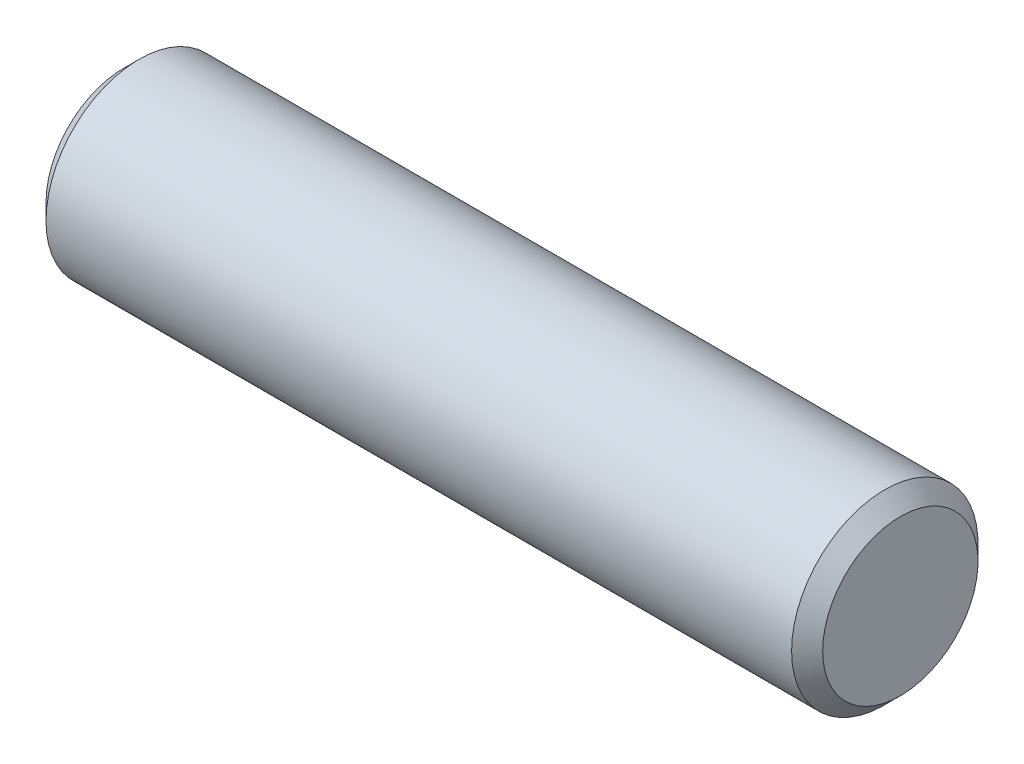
ISO-10303-21;
HEADER;
FILE_DESCRIPTION(('STEP AP214'),'2;1');
FILE_NAME('part.step','',(''),(''),'','','');
FILE_SCHEMA(('AUTOMOTIVE_DESIGN { 1 0 10303 214 1 1 1 1 }'));
ENDSEC;
DATA;
#1=APPLICATION_CONTEXT('core data for automotive mechanical design processes');
#2=APPLICATION_PROTOCOL_DEFINITION('international standard','automotive_design',2000,#1);
#3=PRODUCT_CONTEXT('',#1,'mechanical');
#4=PRODUCT('Part','Part','',(#3));
#5=PRODUCT_RELATED_PRODUCT_CATEGORY('part','',(#4));
#6=PRODUCT_DEFINITION_FORMATION('','',#4);
#7=PRODUCT_DEFINITION_CONTEXT('part definition',#1,'design');
#8=PRODUCT_DEFINITION('design','',#6,#7);
#9=PRODUCT_DEFINITION_SHAPE('','',#8);
#10=(LENGTH_UNIT() NAMED_UNIT(*) SI_UNIT(.MILLI.,.METRE.));
#11=(NAMED_UNIT(*) PLANE_ANGLE_UNIT() SI_UNIT($,.RADIAN.));
#12=(NAMED_UNIT(*) SI_UNIT($,.STERADIAN.) SOLID_ANGLE_UNIT());
#13=UNCERTAINTY_MEASURE_WITH_UNIT(LENGTH_MEASURE(1.E-05),#10,'distance_accuracy_value','');
#14=(GEOMETRIC_REPRESENTATION_CONTEXT(3) GLOBAL_UNCERTAINTY_ASSIGNED_CONTEXT((#13)) GLOBAL_UNIT_ASSIGNED_CONTEXT((#10,
#11,#12)) REPRESENTATION_CONTEXT('',''));
#15=CARTESIAN_POINT('',(0.,0.,0.));
#16=DIRECTION('',(0.,0.,1.));
#17=DIRECTION('',(1.,0.,0.));
#18=AXIS2_PLACEMENT_3D('',#15,#16,#17);
#19=CARTESIAN_POINT('',(-12.5,2.5,0.));
#20=DIRECTION('',(1.,0.,0.));
#21=DIRECTION('',(0.,0.,-1.));
#22=AXIS2_PLACEMENT_3D('',#19,#20,#21);
#23=PLANE('',#22);
#24=CARTESIAN_POINT('',(-12.5,0.,0.));
#25=DIRECTION('',(-1.,0.,0.));
#26=DIRECTION('',(0.,0.,1.));
#27=AXIS2_PLACEMENT_3D('',#24,#25,#26);
#28=CIRCLE('',#27,2.5);
#29=CARTESIAN_POINT('',(-12.5,0.,2.5));
#30=VERTEX_POINT('',#29);
#31=EDGE_CURVE('E362',#30,#30,#28,.T.);
#32=ORIENTED_EDGE('',*,*,#31,.T.);
#33=EDGE_LOOP('',(#32));
#34=FACE_BOUND('',#33,.T.);
#35=ADVANCED_FACE('F348',(#34),#23,.F.);
#36=CARTESIAN_POINT('',(12.5,0.,0.));
#37=DIRECTION('',(-1.,0.,0.));
#38=DIRECTION('',(0.,0.,1.));
#39=AXIS2_PLACEMENT_3D('',#36,#37,#38);
#40=PLANE('',#39);
#41=CARTESIAN_POINT('',(12.5,0.,0.));
#42=DIRECTION('',(-1.,0.,0.));
#43=DIRECTION('',(0.,0.,1.));
#44=AXIS2_PLACEMENT_3D('',#41,#42,#43);
#45=CIRCLE('',#44,2.5);
#46=CARTESIAN_POINT('',(12.5,0.,2.5));
#47=VERTEX_POINT('',#46);
#48=EDGE_CURVE('E10',#47,#47,#45,.T.);
#49=ORIENTED_EDGE('',*,*,#48,.F.);
#50=EDGE_LOOP('',(#49));
#51=FACE_BOUND('',#50,.T.);
#52=ADVANCED_FACE('F382',(#51),#40,.F.);
#53=CARTESIAN_POINT('',(12.5,0.,0.));
#54=DIRECTION('',(-1.,0.,0.));
#55=DIRECTION('',(0.,0.,1.));
#56=AXIS2_PLACEMENT_3D('',#53,#54,#55);
#57=CONICAL_SURFACE('',#56,2.5,0.785398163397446);
#58=CARTESIAN_POINT('',(12.,0.,0.));
#59=DIRECTION('',(-1.,0.,0.));
#60=DIRECTION('',(0.,0.,1.));
#61=AXIS2_PLACEMENT_3D('',#58,#59,#60);
#62=CIRCLE('',#61,3.);
#63=CARTESIAN_POINT('',(12.,0.,3.));
#64=VERTEX_POINT('',#63);
#65=EDGE_CURVE('E354',#64,#64,#62,.T.);
#66=ORIENTED_EDGE('',*,*,#65,.F.);
#67=EDGE_LOOP('',(#66));
#68=FACE_BOUND('',#67,.T.);
#69=ORIENTED_EDGE('',*,*,#48,.T.);
#70=EDGE_LOOP('',(#69));
#71=FACE_BOUND('',#70,.T.);
#72=ADVANCED_FACE('F377',(#68,#71),#57,.T.);
#73=CARTESIAN_POINT('',(-48.,0.,0.));
#74=DIRECTION('',(-1.,0.,0.));
#75=DIRECTION('',(0.,0.,1.));
#76=AXIS2_PLACEMENT_3D('',#73,#74,#75);
#77=CYLINDRICAL_SURFACE('',#76,3.);
#78=CARTESIAN_POINT('',(-12.,0.,0.));
#79=DIRECTION('',(-1.,0.,0.));
#80=DIRECTION('',(0.,0.,1.));
#81=AXIS2_PLACEMENT_3D('',#78,#79,#80);
#82=CIRCLE('',#81,3.);
#83=CARTESIAN_POINT('',(-12.,0.,3.));
#84=VERTEX_POINT('',#83);
#85=EDGE_CURVE('E358',#84,#84,#82,.T.);
#86=ORIENTED_EDGE('',*,*,#85,.F.);
#87=EDGE_LOOP('',(#86));
#88=FACE_BOUND('',#87,.T.);
#89=ORIENTED_EDGE('',*,*,#65,.T.);
#90=EDGE_LOOP('',(#89));
#91=FACE_BOUND('',#90,.T.);
#92=ADVANCED_FACE('F372',(#88,#91),#77,.T.);
#93=CARTESIAN_POINT('',(-12.,0.,0.));
#94=DIRECTION('',(1.,0.,0.));
#95=DIRECTION('',(0.,0.,-1.));
#96=AXIS2_PLACEMENT_3D('',#93,#94,#95);
#97=CONICAL_SURFACE('',#96,3.,0.785398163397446);
#98=ORIENTED_EDGE('',*,*,#31,.F.);
#99=EDGE_LOOP('',(#98));
#100=FACE_BOUND('',#99,.T.);
#101=ORIENTED_EDGE('',*,*,#85,.T.);
#102=EDGE_LOOP('',(#101));
#103=FACE_BOUND('',#102,.T.);
#104=ADVANCED_FACE('F369',(#100,#103),#97,.T.);
#105=CLOSED_SHELL('',(#35,#52,#72,#92,#104));
#106=MANIFOLD_SOLID_BREP('B2',#105);
#107=ADVANCED_BREP_SHAPE_REPRESENTATION('',(#18,#106),#14);
#108=SHAPE_DEFINITION_REPRESENTATION(#9,#107);
ENDSEC;
END-ISO-10303-21;
